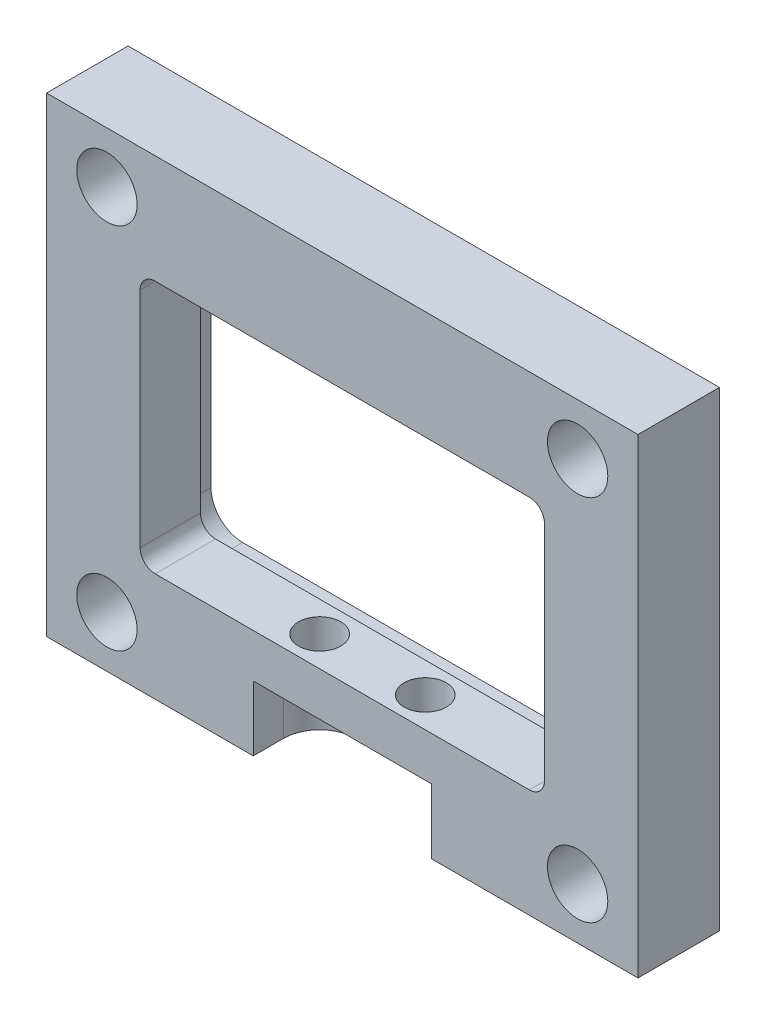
ISO-10303-21;
HEADER;
FILE_DESCRIPTION(('STEP AP214'),'2;1');
FILE_NAME('part.step','',(''),(''),'','','');
FILE_SCHEMA(('AUTOMOTIVE_DESIGN { 1 0 10303 214 1 1 1 1 }'));
ENDSEC;
DATA;
#1=APPLICATION_CONTEXT('core data for automotive mechanical design processes');
#2=APPLICATION_PROTOCOL_DEFINITION('international standard','automotive_design',2000,#1);
#3=PRODUCT_CONTEXT('',#1,'mechanical');
#4=PRODUCT('Part','Part','',(#3));
#5=PRODUCT_RELATED_PRODUCT_CATEGORY('part','',(#4));
#6=PRODUCT_DEFINITION_FORMATION('','',#4);
#7=PRODUCT_DEFINITION_CONTEXT('part definition',#1,'design');
#8=PRODUCT_DEFINITION('design','',#6,#7);
#9=PRODUCT_DEFINITION_SHAPE('','',#8);
#10=(LENGTH_UNIT() NAMED_UNIT(*) SI_UNIT(.MILLI.,.METRE.));
#11=(NAMED_UNIT(*) PLANE_ANGLE_UNIT() SI_UNIT($,.RADIAN.));
#12=(NAMED_UNIT(*) SI_UNIT($,.STERADIAN.) SOLID_ANGLE_UNIT());
#13=UNCERTAINTY_MEASURE_WITH_UNIT(LENGTH_MEASURE(1.E-05),#10,'distance_accuracy_value','');
#14=(GEOMETRIC_REPRESENTATION_CONTEXT(3) GLOBAL_UNCERTAINTY_ASSIGNED_CONTEXT((#13)) GLOBAL_UNIT_ASSIGNED_CONTEXT((#10,
#11,#12)) REPRESENTATION_CONTEXT('',''));
#15=CARTESIAN_POINT('',(0.,0.,0.));
#16=DIRECTION('',(0.,0.,1.));
#17=DIRECTION('',(1.,0.,0.));
#18=AXIS2_PLACEMENT_3D('',#15,#16,#17);
#19=CARTESIAN_POINT('',(57.,-42.0000000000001,27.));
#20=DIRECTION('',(0.,-1.,0.));
#21=DIRECTION('',(0.,0.,1.));
#22=AXIS2_PLACEMENT_3D('',#19,#20,#21);
#23=PLANE('',#22);
#24=CARTESIAN_POINT('',(-17.5,-42.,17.0000000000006));
#25=DIRECTION('',(0.,-1.,0.));
#26=DIRECTION('',(1.,0.,0.));
#27=AXIS2_PLACEMENT_3D('',#24,#25,#26);
#28=CIRCLE('',#27,6.99999999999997);
#29=CARTESIAN_POINT('',(-10.5,-42.,17.0000000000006));
#30=VERTEX_POINT('',#29);
#31=EDGE_CURVE('E1139',#30,#30,#28,.T.);
#32=ORIENTED_EDGE('',*,*,#31,.T.);
#33=EDGE_LOOP('',(#32));
#34=FACE_BOUND('',#33,.T.);
#35=CARTESIAN_POINT('',(17.5,-42.0000000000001,17.0000000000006));
#36=DIRECTION('',(0.,-1.,0.));
#37=DIRECTION('',(1.,0.,0.));
#38=AXIS2_PLACEMENT_3D('',#35,#36,#37);
#39=CIRCLE('',#38,6.99999999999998);
#40=CARTESIAN_POINT('',(24.5,-42.0000000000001,17.0000000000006));
#41=VERTEX_POINT('',#40);
#42=EDGE_CURVE('E251',#41,#41,#39,.T.);
#43=ORIENTED_EDGE('',*,*,#42,.T.);
#44=EDGE_LOOP('',(#43));
#45=FACE_BOUND('',#44,.T.);
#46=DIRECTION('',(-1.,0.,0.));
#47=VECTOR('',#46,1.);
#48=CARTESIAN_POINT('',(57.,-42.0000000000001,7.));
#49=LINE('',#48,#47);
#50=CARTESIAN_POINT('',(62.,-42.0000000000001,7.));
#51=VERTEX_POINT('',#50);
#52=CARTESIAN_POINT('',(-62.,-42.,7.));
#53=VERTEX_POINT('',#52);
#54=EDGE_CURVE('E492',#51,#53,#49,.T.);
#55=ORIENTED_EDGE('',*,*,#54,.T.);
#56=DIRECTION('',(0.,0.,1.));
#57=VECTOR('',#56,1.);
#58=CARTESIAN_POINT('',(-62.,-42.,0.));
#59=LINE('',#58,#57);
#60=CARTESIAN_POINT('',(-62.,-42.,27.));
#61=VERTEX_POINT('',#60);
#62=EDGE_CURVE('E376',#53,#61,#59,.T.);
#63=ORIENTED_EDGE('',*,*,#62,.T.);
#64=DIRECTION('',(-1.,0.,0.));
#65=VECTOR('',#64,1.);
#66=CARTESIAN_POINT('',(57.,-42.0000000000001,27.));
#67=LINE('',#66,#65);
#68=CARTESIAN_POINT('',(62.,-42.,27.));
#69=VERTEX_POINT('',#68);
#70=EDGE_CURVE('E500',#69,#61,#67,.T.);
#71=ORIENTED_EDGE('',*,*,#70,.F.);
#72=DIRECTION('',(0.,0.,1.));
#73=VECTOR('',#72,1.);
#74=CARTESIAN_POINT('',(62.,-42.,0.));
#75=LINE('',#74,#73);
#76=EDGE_CURVE('E373',#51,#69,#75,.T.);
#77=ORIENTED_EDGE('',*,*,#76,.F.);
#78=EDGE_LOOP('',(#55,#63,#71,#77));
#79=FACE_BOUND('',#78,.T.);
#80=ADVANCED_FACE('F45',(#34,#45,#79),#23,.F.);
#81=CARTESIAN_POINT('',(17.5,-56.5,17.0000000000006));
#82=DIRECTION('',(0.,1.,0.));
#83=DIRECTION('',(0.,0.,1.));
#84=AXIS2_PLACEMENT_3D('',#81,#82,#83);
#85=PLANE('',#84);
#86=CARTESIAN_POINT('',(-17.5,-56.5,17.0000000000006));
#87=DIRECTION('',(0.,-1.,0.));
#88=DIRECTION('',(0.,0.,-1.));
#89=AXIS2_PLACEMENT_3D('',#86,#87,#88);
#90=CIRCLE('',#89,6.99999999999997);
#91=CARTESIAN_POINT('',(-17.5,-56.5,10.0000000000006));
#92=VERTEX_POINT('',#91);
#93=EDGE_CURVE('E1137',#92,#92,#90,.T.);
#94=ORIENTED_EDGE('',*,*,#93,.F.);
#95=EDGE_LOOP('',(#94));
#96=FACE_BOUND('',#95,.T.);
#97=CARTESIAN_POINT('',(17.5,-56.5,17.0000000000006));
#98=DIRECTION('',(0.,-1.,0.));
#99=DIRECTION('',(0.,0.,-1.));
#100=AXIS2_PLACEMENT_3D('',#97,#98,#99);
#101=CIRCLE('',#100,6.99999999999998);
#102=CARTESIAN_POINT('',(17.5,-56.5,10.0000000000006));
#103=VERTEX_POINT('',#102);
#104=EDGE_CURVE('E254',#103,#103,#101,.T.);
#105=ORIENTED_EDGE('',*,*,#104,.F.);
#106=EDGE_LOOP('',(#105));
#107=FACE_BOUND('',#106,.T.);
#108=CARTESIAN_POINT('',(17.5,-56.5,17.0000000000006));
#109=DIRECTION('',(0.,1.,0.));
#110=DIRECTION('',(0.,0.,1.));
#111=AXIS2_PLACEMENT_3D('',#108,#109,#110);
#112=CIRCLE('',#111,12.);
#113=CARTESIAN_POINT('',(29.5,-56.5,17.0000000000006));
#114=VERTEX_POINT('',#113);
#115=CARTESIAN_POINT('',(17.5,-56.5,5.0000000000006));
#116=VERTEX_POINT('',#115);
#117=EDGE_CURVE('E245',#114,#116,#112,.T.);
#118=ORIENTED_EDGE('',*,*,#117,.F.);
#119=DIRECTION('',(0.,0.,-1.));
#120=VECTOR('',#119,1.);
#121=CARTESIAN_POINT('',(29.5,-56.5,17.0000000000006));
#122=LINE('',#121,#120);
#123=CARTESIAN_POINT('',(29.5,-56.5,27.));
#124=VERTEX_POINT('',#123);
#125=EDGE_CURVE('E273',#124,#114,#122,.T.);
#126=ORIENTED_EDGE('',*,*,#125,.F.);
#127=DIRECTION('',(1.,0.,0.));
#128=VECTOR('',#127,1.);
#129=CARTESIAN_POINT('',(-29.5,-56.5,27.));
#130=LINE('',#129,#128);
#131=CARTESIAN_POINT('',(-29.5,-56.5,27.));
#132=VERTEX_POINT('',#131);
#133=EDGE_CURVE('E270',#132,#124,#130,.T.);
#134=ORIENTED_EDGE('',*,*,#133,.F.);
#135=DIRECTION('',(0.,0.,1.));
#136=VECTOR('',#135,1.);
#137=CARTESIAN_POINT('',(-29.5,-56.5,17.0000000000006));
#138=LINE('',#137,#136);
#139=CARTESIAN_POINT('',(-29.5,-56.5,17.0000000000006));
#140=VERTEX_POINT('',#139);
#141=EDGE_CURVE('E268',#140,#132,#138,.T.);
#142=ORIENTED_EDGE('',*,*,#141,.F.);
#143=CARTESIAN_POINT('',(-17.5,-56.5,17.0000000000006));
#144=DIRECTION('',(0.,1.,0.));
#145=DIRECTION('',(0.,0.,1.));
#146=AXIS2_PLACEMENT_3D('',#143,#144,#145);
#147=CIRCLE('',#146,12.);
#148=CARTESIAN_POINT('',(-17.5,-56.5,5.00000000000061));
#149=VERTEX_POINT('',#148);
#150=EDGE_CURVE('E266',#149,#140,#147,.T.);
#151=ORIENTED_EDGE('',*,*,#150,.F.);
#152=DIRECTION('',(-1.,0.,0.));
#153=VECTOR('',#152,1.);
#154=CARTESIAN_POINT('',(17.5,-56.5,5.0000000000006));
#155=LINE('',#154,#153);
#156=EDGE_CURVE('E264',#116,#149,#155,.T.);
#157=ORIENTED_EDGE('',*,*,#156,.F.);
#158=EDGE_LOOP('',(#118,#126,#134,#142,#151,#157));
#159=FACE_BOUND('',#158,.T.);
#160=ADVANCED_FACE('F549',(#96,#107,#159),#85,.F.);
#161=CARTESIAN_POINT('',(0.,0.,27.));
#162=DIRECTION('',(0.,0.,1.));
#163=DIRECTION('',(1.,0.,0.));
#164=AXIS2_PLACEMENT_3D('',#161,#162,#163);
#165=PLANE('',#164);
#166=CARTESIAN_POINT('',(-78.,-61.,27.));
#167=DIRECTION('',(0.,0.,1.));
#168=DIRECTION('',(1.,0.,0.));
#169=AXIS2_PLACEMENT_3D('',#166,#167,#168);
#170=CIRCLE('',#169,10.);
#171=CARTESIAN_POINT('',(-68.,-61.,27.));
#172=VERTEX_POINT('',#171);
#173=EDGE_CURVE('E421',#172,#172,#170,.T.);
#174=ORIENTED_EDGE('',*,*,#173,.F.);
#175=EDGE_LOOP('',(#174));
#176=FACE_BOUND('',#175,.T.);
#177=CARTESIAN_POINT('',(78.,-61.,27.));
#178=DIRECTION('',(0.,0.,1.));
#179=DIRECTION('',(1.,0.,0.));
#180=AXIS2_PLACEMENT_3D('',#177,#178,#179);
#181=CIRCLE('',#180,10.);
#182=CARTESIAN_POINT('',(88.,-61.,27.));
#183=VERTEX_POINT('',#182);
#184=EDGE_CURVE('E413',#183,#183,#181,.T.);
#185=ORIENTED_EDGE('',*,*,#184,.F.);
#186=EDGE_LOOP('',(#185));
#187=FACE_BOUND('',#186,.T.);
#188=CARTESIAN_POINT('',(-78.,61.,27.));
#189=DIRECTION('',(0.,0.,1.));
#190=DIRECTION('',(1.,0.,0.));
#191=AXIS2_PLACEMENT_3D('',#188,#189,#190);
#192=CIRCLE('',#191,10.);
#193=CARTESIAN_POINT('',(-68.,61.,27.));
#194=VERTEX_POINT('',#193);
#195=EDGE_CURVE('E405',#194,#194,#192,.T.);
#196=ORIENTED_EDGE('',*,*,#195,.F.);
#197=EDGE_LOOP('',(#196));
#198=FACE_BOUND('',#197,.T.);
#199=CARTESIAN_POINT('',(78.,61.,27.));
#200=DIRECTION('',(0.,0.,1.));
#201=DIRECTION('',(1.,0.,0.));
#202=AXIS2_PLACEMENT_3D('',#199,#200,#201);
#203=CIRCLE('',#202,10.);
#204=CARTESIAN_POINT('',(88.,61.,27.));
#205=VERTEX_POINT('',#204);
#206=EDGE_CURVE('E404',#205,#205,#203,.T.);
#207=ORIENTED_EDGE('',*,*,#206,.F.);
#208=EDGE_LOOP('',(#207));
#209=FACE_BOUND('',#208,.T.);
#210=DIRECTION('',(1.,0.,0.));
#211=VECTOR('',#210,1.);
#212=CARTESIAN_POINT('',(57.,42.,27.));
#213=LINE('',#212,#211);
#214=CARTESIAN_POINT('',(-62.,42.,27.));
#215=VERTEX_POINT('',#214);
#216=CARTESIAN_POINT('',(62.,42.,27.));
#217=VERTEX_POINT('',#216);
#218=EDGE_CURVE('E387',#215,#217,#213,.T.);
#219=ORIENTED_EDGE('',*,*,#218,.T.);
#220=CARTESIAN_POINT('',(62.,37.,27.));
#221=DIRECTION('',(0.,0.,1.));
#222=DIRECTION('',(-1.,0.,0.));
#223=AXIS2_PLACEMENT_3D('',#220,#221,#222);
#224=CIRCLE('',#223,5.);
#225=CARTESIAN_POINT('',(67.,37.,27.));
#226=VERTEX_POINT('',#225);
#227=EDGE_CURVE('E356',#226,#217,#224,.T.);
#228=ORIENTED_EDGE('',*,*,#227,.F.);
#229=DIRECTION('',(0.,-1.,0.));
#230=VECTOR('',#229,1.);
#231=CARTESIAN_POINT('',(67.,32.,27.));
#232=LINE('',#231,#230);
#233=CARTESIAN_POINT('',(67.,-37.0000000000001,27.));
#234=VERTEX_POINT('',#233);
#235=EDGE_CURVE('E498',#226,#234,#232,.T.);
#236=ORIENTED_EDGE('',*,*,#235,.T.);
#237=CARTESIAN_POINT('',(62.,-37.0000000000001,27.));
#238=DIRECTION('',(0.,0.,1.));
#239=DIRECTION('',(-1.,0.,0.));
#240=AXIS2_PLACEMENT_3D('',#237,#238,#239);
#241=CIRCLE('',#240,5.);
#242=EDGE_CURVE('E353',#69,#234,#241,.T.);
#243=ORIENTED_EDGE('',*,*,#242,.F.);
#244=ORIENTED_EDGE('',*,*,#70,.T.);
#245=CARTESIAN_POINT('',(-62.,-37.,27.));
#246=DIRECTION('',(0.,0.,1.));
#247=DIRECTION('',(-1.,0.,0.));
#248=AXIS2_PLACEMENT_3D('',#245,#246,#247);
#249=CIRCLE('',#248,5.);
#250=CARTESIAN_POINT('',(-67.,-37.,27.));
#251=VERTEX_POINT('',#250);
#252=EDGE_CURVE('E350',#251,#61,#249,.T.);
#253=ORIENTED_EDGE('',*,*,#252,.F.);
#254=DIRECTION('',(0.,1.,0.));
#255=VECTOR('',#254,1.);
#256=CARTESIAN_POINT('',(-67.,32.,27.));
#257=LINE('',#256,#255);
#258=CARTESIAN_POINT('',(-67.,37.,27.));
#259=VERTEX_POINT('',#258);
#260=EDGE_CURVE('E455',#251,#259,#257,.T.);
#261=ORIENTED_EDGE('',*,*,#260,.T.);
#262=CARTESIAN_POINT('',(-62.,37.,27.));
#263=DIRECTION('',(0.,0.,1.));
#264=DIRECTION('',(-1.,0.,0.));
#265=AXIS2_PLACEMENT_3D('',#262,#263,#264);
#266=CIRCLE('',#265,5.);
#267=EDGE_CURVE('E334',#215,#259,#266,.T.);
#268=ORIENTED_EDGE('',*,*,#267,.F.);
#269=EDGE_LOOP('',(#219,#228,#236,#243,#244,#253,#261,#268));
#270=FACE_BOUND('',#269,.T.);
#271=DIRECTION('',(-1.,0.,0.));
#272=VECTOR('',#271,1.);
#273=CARTESIAN_POINT('',(0.,-78.,27.));
#274=LINE('',#273,#272);
#275=CARTESIAN_POINT('',(-29.5,-78.,27.));
#276=VERTEX_POINT('',#275);
#277=CARTESIAN_POINT('',(-98.,-78.,27.));
#278=VERTEX_POINT('',#277);
#279=EDGE_CURVE('E433',#276,#278,#274,.T.);
#280=ORIENTED_EDGE('',*,*,#279,.F.);
#281=DIRECTION('',(0.,-1.,0.));
#282=VECTOR('',#281,1.);
#283=CARTESIAN_POINT('',(-29.5,-56.5,27.));
#284=LINE('',#283,#282);
#285=EDGE_CURVE('E280',#132,#276,#284,.T.);
#286=ORIENTED_EDGE('',*,*,#285,.F.);
#287=ORIENTED_EDGE('',*,*,#133,.T.);
#288=DIRECTION('',(0.,-1.,0.));
#289=VECTOR('',#288,1.);
#290=CARTESIAN_POINT('',(29.5,-56.5,27.));
#291=LINE('',#290,#289);
#292=CARTESIAN_POINT('',(29.5,-78.,27.));
#293=VERTEX_POINT('',#292);
#294=EDGE_CURVE('E277',#124,#293,#291,.T.);
#295=ORIENTED_EDGE('',*,*,#294,.T.);
#296=CARTESIAN_POINT('',(98.,-78.,27.));
#297=VERTEX_POINT('',#296);
#298=EDGE_CURVE('E430',#297,#293,#274,.T.);
#299=ORIENTED_EDGE('',*,*,#298,.F.);
#300=DIRECTION('',(0.,-1.,0.));
#301=VECTOR('',#300,1.);
#302=CARTESIAN_POINT('',(98.,0.,27.));
#303=LINE('',#302,#301);
#304=CARTESIAN_POINT('',(98.,78.,27.));
#305=VERTEX_POINT('',#304);
#306=EDGE_CURVE('E429',#305,#297,#303,.T.);
#307=ORIENTED_EDGE('',*,*,#306,.F.);
#308=DIRECTION('',(1.,0.,0.));
#309=VECTOR('',#308,1.);
#310=CARTESIAN_POINT('',(0.,78.,27.));
#311=LINE('',#310,#309);
#312=CARTESIAN_POINT('',(-98.,78.,27.));
#313=VERTEX_POINT('',#312);
#314=EDGE_CURVE('E438',#313,#305,#311,.T.);
#315=ORIENTED_EDGE('',*,*,#314,.F.);
#316=DIRECTION('',(0.,1.,0.));
#317=VECTOR('',#316,1.);
#318=CARTESIAN_POINT('',(-98.,0.,27.));
#319=LINE('',#318,#317);
#320=EDGE_CURVE('E434',#278,#313,#319,.T.);
#321=ORIENTED_EDGE('',*,*,#320,.F.);
#322=EDGE_LOOP('',(#280,#286,#287,#295,#299,#307,#315,#321));
#323=FACE_BOUND('',#322,.T.);
#324=ADVANCED_FACE('F529',(#176,#187,#198,#209,#270,#323),#165,.T.);
#325=CARTESIAN_POINT('',(0.,-78.,0.));
#326=DIRECTION('',(0.,-1.,0.));
#327=DIRECTION('',(0.,0.,-1.));
#328=AXIS2_PLACEMENT_3D('',#325,#326,#327);
#329=PLANE('',#328);
#330=CARTESIAN_POINT('',(-17.5,-78.,17.0000000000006));
#331=DIRECTION('',(0.,1.,0.));
#332=DIRECTION('',(0.,0.,1.));
#333=AXIS2_PLACEMENT_3D('',#330,#331,#332);
#334=CIRCLE('',#333,12.);
#335=CARTESIAN_POINT('',(-17.5,-78.,5.00000000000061));
#336=VERTEX_POINT('',#335);
#337=CARTESIAN_POINT('',(-29.5,-78.,17.0000000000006));
#338=VERTEX_POINT('',#337);
#339=EDGE_CURVE('E240',#336,#338,#334,.T.);
#340=ORIENTED_EDGE('',*,*,#339,.T.);
#341=DIRECTION('',(0.,0.,1.));
#342=VECTOR('',#341,1.);
#343=CARTESIAN_POINT('',(-29.5,-78.,17.0000000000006));
#344=LINE('',#343,#342);
#345=EDGE_CURVE('E259',#338,#276,#344,.T.);
#346=ORIENTED_EDGE('',*,*,#345,.T.);
#347=ORIENTED_EDGE('',*,*,#279,.T.);
#348=DIRECTION('',(0.,0.,1.));
#349=VECTOR('',#348,1.);
#350=CARTESIAN_POINT('',(-98.,-78.,0.));
#351=LINE('',#350,#349);
#352=CARTESIAN_POINT('',(-98.,-78.,0.));
#353=VERTEX_POINT('',#352);
#354=EDGE_CURVE('E437',#353,#278,#351,.T.);
#355=ORIENTED_EDGE('',*,*,#354,.F.);
#356=DIRECTION('',(1.,0.,0.));
#357=VECTOR('',#356,1.);
#358=CARTESIAN_POINT('',(0.,-78.,0.));
#359=LINE('',#358,#357);
#360=CARTESIAN_POINT('',(98.,-78.,0.));
#361=VERTEX_POINT('',#360);
#362=EDGE_CURVE('E432',#353,#361,#359,.T.);
#363=ORIENTED_EDGE('',*,*,#362,.T.);
#364=DIRECTION('',(0.,0.,1.));
#365=VECTOR('',#364,1.);
#366=CARTESIAN_POINT('',(98.,-78.,0.));
#367=LINE('',#366,#365);
#368=EDGE_CURVE('E452',#361,#297,#367,.T.);
#369=ORIENTED_EDGE('',*,*,#368,.T.);
#370=ORIENTED_EDGE('',*,*,#298,.T.);
#371=DIRECTION('',(0.,0.,-1.));
#372=VECTOR('',#371,1.);
#373=CARTESIAN_POINT('',(29.5,-78.,17.0000000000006));
#374=LINE('',#373,#372);
#375=CARTESIAN_POINT('',(29.5,-78.,17.0000000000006));
#376=VERTEX_POINT('',#375);
#377=EDGE_CURVE('E250',#293,#376,#374,.T.);
#378=ORIENTED_EDGE('',*,*,#377,.T.);
#379=CARTESIAN_POINT('',(17.5,-78.,17.0000000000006));
#380=DIRECTION('',(0.,1.,0.));
#381=DIRECTION('',(0.,0.,1.));
#382=AXIS2_PLACEMENT_3D('',#379,#380,#381);
#383=CIRCLE('',#382,12.);
#384=CARTESIAN_POINT('',(17.5,-78.,5.0000000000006));
#385=VERTEX_POINT('',#384);
#386=EDGE_CURVE('E60',#376,#385,#383,.T.);
#387=ORIENTED_EDGE('',*,*,#386,.T.);
#388=DIRECTION('',(-1.,0.,0.));
#389=VECTOR('',#388,1.);
#390=CARTESIAN_POINT('',(17.5,-78.,5.0000000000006));
#391=LINE('',#390,#389);
#392=EDGE_CURVE('E232',#385,#336,#391,.T.);
#393=ORIENTED_EDGE('',*,*,#392,.T.);
#394=EDGE_LOOP('',(#340,#346,#347,#355,#363,#369,#370,#378,#387,#393));
#395=FACE_BOUND('',#394,.T.);
#396=ADVANCED_FACE('F248',(#395),#329,.T.);
#397=CARTESIAN_POINT('',(0.,0.,0.));
#398=DIRECTION('',(0.,0.,-1.));
#399=DIRECTION('',(-1.,0.,0.));
#400=AXIS2_PLACEMENT_3D('',#397,#398,#399);
#401=PLANE('',#400);
#402=CARTESIAN_POINT('',(60.,34.9999999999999,0.));
#403=DIRECTION('',(0.,0.,-1.));
#404=DIRECTION('',(1.,0.,0.));
#405=AXIS2_PLACEMENT_3D('',#402,#403,#404);
#406=CIRCLE('',#405,10.5);
#407=CARTESIAN_POINT('',(60.,45.4999999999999,0.));
#408=VERTEX_POINT('',#407);
#409=CARTESIAN_POINT('',(70.5,34.9999999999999,0.));
#410=VERTEX_POINT('',#409);
#411=EDGE_CURVE('E68',#408,#410,#406,.T.);
#412=ORIENTED_EDGE('',*,*,#411,.F.);
#413=DIRECTION('',(1.,0.,0.));
#414=VECTOR('',#413,1.);
#415=CARTESIAN_POINT('',(60.,45.4999999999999,0.));
#416=LINE('',#415,#414);
#417=CARTESIAN_POINT('',(-60.,45.5,0.));
#418=VERTEX_POINT('',#417);
#419=EDGE_CURVE('E304',#418,#408,#416,.T.);
#420=ORIENTED_EDGE('',*,*,#419,.F.);
#421=CARTESIAN_POINT('',(-60.,35.,0.));
#422=DIRECTION('',(0.,0.,-1.));
#423=DIRECTION('',(1.,0.,0.));
#424=AXIS2_PLACEMENT_3D('',#421,#422,#423);
#425=CIRCLE('',#424,10.5);
#426=CARTESIAN_POINT('',(-70.5,35.,0.));
#427=VERTEX_POINT('',#426);
#428=EDGE_CURVE('E301',#427,#418,#425,.T.);
#429=ORIENTED_EDGE('',*,*,#428,.F.);
#430=DIRECTION('',(0.,1.,0.));
#431=VECTOR('',#430,1.);
#432=CARTESIAN_POINT('',(-70.5,-35.,0.));
#433=LINE('',#432,#431);
#434=CARTESIAN_POINT('',(-70.5,-35.,0.));
#435=VERTEX_POINT('',#434);
#436=EDGE_CURVE('E298',#435,#427,#433,.T.);
#437=ORIENTED_EDGE('',*,*,#436,.F.);
#438=CARTESIAN_POINT('',(-60.,-35.,0.));
#439=DIRECTION('',(0.,0.,-1.));
#440=DIRECTION('',(1.,0.,0.));
#441=AXIS2_PLACEMENT_3D('',#438,#439,#440);
#442=CIRCLE('',#441,10.5);
#443=CARTESIAN_POINT('',(-60.,-45.5,0.));
#444=VERTEX_POINT('',#443);
#445=EDGE_CURVE('E295',#444,#435,#442,.T.);
#446=ORIENTED_EDGE('',*,*,#445,.F.);
#447=DIRECTION('',(-1.,0.,0.));
#448=VECTOR('',#447,1.);
#449=CARTESIAN_POINT('',(-60.,-45.5,0.));
#450=LINE('',#449,#448);
#451=CARTESIAN_POINT('',(60.,-45.5000000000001,0.));
#452=VERTEX_POINT('',#451);
#453=EDGE_CURVE('E292',#452,#444,#450,.T.);
#454=ORIENTED_EDGE('',*,*,#453,.F.);
#455=CARTESIAN_POINT('',(60.,-35.,0.));
#456=DIRECTION('',(0.,0.,-1.));
#457=DIRECTION('',(-1.,0.,0.));
#458=AXIS2_PLACEMENT_3D('',#455,#456,#457);
#459=CIRCLE('',#458,10.5);
#460=CARTESIAN_POINT('',(70.5,-35.0000000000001,0.));
#461=VERTEX_POINT('',#460);
#462=EDGE_CURVE('E289',#461,#452,#459,.T.);
#463=ORIENTED_EDGE('',*,*,#462,.F.);
#464=DIRECTION('',(0.,-1.,0.));
#465=VECTOR('',#464,1.);
#466=CARTESIAN_POINT('',(70.5,-35.0000000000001,0.));
#467=LINE('',#466,#465);
#468=EDGE_CURVE('E286',#410,#461,#467,.T.);
#469=ORIENTED_EDGE('',*,*,#468,.F.);
#470=EDGE_LOOP('',(#412,#420,#429,#437,#446,#454,#463,#469));
#471=FACE_BOUND('',#470,.T.);
#472=CARTESIAN_POINT('',(-57.,61.,0.));
#473=DIRECTION('',(0.,0.,-1.));
#474=DIRECTION('',(-1.,0.,0.));
#475=AXIS2_PLACEMENT_3D('',#472,#473,#474);
#476=CIRCLE('',#475,4.188125);
#477=CARTESIAN_POINT('',(-61.188125,61.,0.));
#478=VERTEX_POINT('',#477);
#479=EDGE_CURVE('E363',#478,#478,#476,.F.);
#480=ORIENTED_EDGE('',*,*,#479,.T.);
#481=EDGE_LOOP('',(#480));
#482=FACE_BOUND('',#481,.T.);
#483=CARTESIAN_POINT('',(-57.,-61.,0.));
#484=DIRECTION('',(0.,0.,-1.));
#485=DIRECTION('',(-1.,0.,0.));
#486=AXIS2_PLACEMENT_3D('',#483,#484,#485);
#487=CIRCLE('',#486,4.188125);
#488=CARTESIAN_POINT('',(-61.188125,-61.,0.));
#489=VERTEX_POINT('',#488);
#490=EDGE_CURVE('E391',#489,#489,#487,.F.);
#491=ORIENTED_EDGE('',*,*,#490,.T.);
#492=EDGE_LOOP('',(#491));
#493=FACE_BOUND('',#492,.T.);
#494=CARTESIAN_POINT('',(78.,61.,0.));
#495=DIRECTION('',(0.,0.,-1.));
#496=DIRECTION('',(-1.,0.,0.));
#497=AXIS2_PLACEMENT_3D('',#494,#495,#496);
#498=CIRCLE('',#497,13.);
#499=CARTESIAN_POINT('',(65.,61.,0.));
#500=VERTEX_POINT('',#499);
#501=EDGE_CURVE('E396',#500,#500,#498,.T.);
#502=ORIENTED_EDGE('',*,*,#501,.F.);
#503=EDGE_LOOP('',(#502));
#504=FACE_BOUND('',#503,.T.);
#505=CARTESIAN_POINT('',(-78.,61.,0.));
#506=DIRECTION('',(0.,0.,-1.));
#507=DIRECTION('',(-1.,0.,0.));
#508=AXIS2_PLACEMENT_3D('',#505,#506,#507);
#509=CIRCLE('',#508,13.);
#510=CARTESIAN_POINT('',(-91.,61.,0.));
#511=VERTEX_POINT('',#510);
#512=EDGE_CURVE('E406',#511,#511,#509,.T.);
#513=ORIENTED_EDGE('',*,*,#512,.F.);
#514=EDGE_LOOP('',(#513));
#515=FACE_BOUND('',#514,.T.);
#516=CARTESIAN_POINT('',(78.,-61.,0.));
#517=DIRECTION('',(0.,0.,-1.));
#518=DIRECTION('',(-1.,0.,0.));
#519=AXIS2_PLACEMENT_3D('',#516,#517,#518);
#520=CIRCLE('',#519,13.);
#521=CARTESIAN_POINT('',(65.,-61.,0.));
#522=VERTEX_POINT('',#521);
#523=EDGE_CURVE('E414',#522,#522,#520,.T.);
#524=ORIENTED_EDGE('',*,*,#523,.F.);
#525=EDGE_LOOP('',(#524));
#526=FACE_BOUND('',#525,.T.);
#527=CARTESIAN_POINT('',(-78.,-61.,0.));
#528=DIRECTION('',(0.,0.,-1.));
#529=DIRECTION('',(-1.,0.,0.));
#530=AXIS2_PLACEMENT_3D('',#527,#528,#529);
#531=CIRCLE('',#530,13.);
#532=CARTESIAN_POINT('',(-91.,-61.,0.));
#533=VERTEX_POINT('',#532);
#534=EDGE_CURVE('E422',#533,#533,#531,.T.);
#535=ORIENTED_EDGE('',*,*,#534,.F.);
#536=EDGE_LOOP('',(#535));
#537=FACE_BOUND('',#536,.T.);
#538=DIRECTION('',(0.,1.,0.));
#539=VECTOR('',#538,1.);
#540=CARTESIAN_POINT('',(98.,0.,0.));
#541=LINE('',#540,#539);
#542=CARTESIAN_POINT('',(98.,78.,0.));
#543=VERTEX_POINT('',#542);
#544=EDGE_CURVE('E451',#361,#543,#541,.T.);
#545=ORIENTED_EDGE('',*,*,#544,.F.);
#546=ORIENTED_EDGE('',*,*,#362,.F.);
#547=DIRECTION('',(0.,-1.,0.));
#548=VECTOR('',#547,1.);
#549=CARTESIAN_POINT('',(-98.,0.,0.));
#550=LINE('',#549,#548);
#551=CARTESIAN_POINT('',(-98.,78.,0.));
#552=VERTEX_POINT('',#551);
#553=EDGE_CURVE('E436',#552,#353,#550,.T.);
#554=ORIENTED_EDGE('',*,*,#553,.F.);
#555=DIRECTION('',(-1.,0.,0.));
#556=VECTOR('',#555,1.);
#557=CARTESIAN_POINT('',(0.,78.,0.));
#558=LINE('',#557,#556);
#559=EDGE_CURVE('E440',#543,#552,#558,.T.);
#560=ORIENTED_EDGE('',*,*,#559,.F.);
#561=EDGE_LOOP('',(#545,#546,#554,#560));
#562=FACE_BOUND('',#561,.T.);
#563=CARTESIAN_POINT('',(57.,-61.,0.));
#564=DIRECTION('',(0.,0.,-1.));
#565=DIRECTION('',(-1.,0.,0.));
#566=AXIS2_PLACEMENT_3D('',#563,#564,#565);
#567=CIRCLE('',#566,4.188125);
#568=CARTESIAN_POINT('',(52.811875,-61.,0.));
#569=VERTEX_POINT('',#568);
#570=EDGE_CURVE('E388',#569,#569,#567,.F.);
#571=ORIENTED_EDGE('',*,*,#570,.T.);
#572=EDGE_LOOP('',(#571));
#573=FACE_BOUND('',#572,.T.);
#574=CARTESIAN_POINT('',(57.,61.,0.));
#575=DIRECTION('',(0.,0.,-1.));
#576=DIRECTION('',(-1.,0.,0.));
#577=AXIS2_PLACEMENT_3D('',#574,#575,#576);
#578=CIRCLE('',#577,4.188125);
#579=CARTESIAN_POINT('',(52.811875,61.,0.));
#580=VERTEX_POINT('',#579);
#581=EDGE_CURVE('E384',#580,#580,#578,.F.);
#582=ORIENTED_EDGE('',*,*,#581,.T.);
#583=EDGE_LOOP('',(#582));
#584=FACE_BOUND('',#583,.T.);
#585=ADVANCED_FACE('F47',(#471,#482,#493,#504,#515,#526,#537,#562,#573,#584),#401,.T.);
#586=CARTESIAN_POINT('',(-98.,0.,0.));
#587=DIRECTION('',(-1.,0.,0.));
#588=DIRECTION('',(0.,0.,1.));
#589=AXIS2_PLACEMENT_3D('',#586,#587,#588);
#590=PLANE('',#589);
#591=ORIENTED_EDGE('',*,*,#354,.T.);
#592=ORIENTED_EDGE('',*,*,#320,.T.);
#593=DIRECTION('',(0.,0.,1.));
#594=VECTOR('',#593,1.);
#595=CARTESIAN_POINT('',(-98.,78.,0.));
#596=LINE('',#595,#594);
#597=EDGE_CURVE('E441',#552,#313,#596,.T.);
#598=ORIENTED_EDGE('',*,*,#597,.F.);
#599=ORIENTED_EDGE('',*,*,#553,.T.);
#600=EDGE_LOOP('',(#591,#592,#598,#599));
#601=FACE_BOUND('',#600,.T.);
#602=ADVANCED_FACE('F773',(#601),#590,.T.);
#603=CARTESIAN_POINT('',(0.,78.,0.));
#604=DIRECTION('',(0.,1.,0.));
#605=DIRECTION('',(0.,0.,1.));
#606=AXIS2_PLACEMENT_3D('',#603,#604,#605);
#607=PLANE('',#606);
#608=ORIENTED_EDGE('',*,*,#597,.T.);
#609=ORIENTED_EDGE('',*,*,#314,.T.);
#610=DIRECTION('',(0.,0.,1.));
#611=VECTOR('',#610,1.);
#612=CARTESIAN_POINT('',(98.,78.,0.));
#613=LINE('',#612,#611);
#614=EDGE_CURVE('E444',#543,#305,#613,.T.);
#615=ORIENTED_EDGE('',*,*,#614,.F.);
#616=ORIENTED_EDGE('',*,*,#559,.T.);
#617=EDGE_LOOP('',(#608,#609,#615,#616));
#618=FACE_BOUND('',#617,.T.);
#619=ADVANCED_FACE('F763',(#618),#607,.T.);
#620=CARTESIAN_POINT('',(98.,0.,0.));
#621=DIRECTION('',(1.,0.,0.));
#622=DIRECTION('',(0.,0.,-1.));
#623=AXIS2_PLACEMENT_3D('',#620,#621,#622);
#624=PLANE('',#623);
#625=ORIENTED_EDGE('',*,*,#544,.T.);
#626=ORIENTED_EDGE('',*,*,#614,.T.);
#627=ORIENTED_EDGE('',*,*,#306,.T.);
#628=ORIENTED_EDGE('',*,*,#368,.F.);
#629=EDGE_LOOP('',(#625,#626,#627,#628));
#630=FACE_BOUND('',#629,.T.);
#631=ADVANCED_FACE('F753',(#630),#624,.T.);
#632=CARTESIAN_POINT('',(-78.,-61.,-1.));
#633=DIRECTION('',(0.,0.,1.));
#634=DIRECTION('',(0.,1.,0.));
#635=AXIS2_PLACEMENT_3D('',#632,#633,#634);
#636=CYLINDRICAL_SURFACE('',#635,10.);
#637=CARTESIAN_POINT('',(-78.,-61.,6.3));
#638=DIRECTION('',(0.,0.,1.));
#639=DIRECTION('',(1.,0.,0.));
#640=AXIS2_PLACEMENT_3D('',#637,#638,#639);
#641=CIRCLE('',#640,10.);
#642=CARTESIAN_POINT('',(-68.,-61.,6.3));
#643=VERTEX_POINT('',#642);
#644=EDGE_CURVE('E426',#643,#643,#641,.F.);
#645=ORIENTED_EDGE('',*,*,#644,.T.);
#646=EDGE_LOOP('',(#645));
#647=FACE_BOUND('',#646,.T.);
#648=ORIENTED_EDGE('',*,*,#173,.T.);
#649=EDGE_LOOP('',(#648));
#650=FACE_BOUND('',#649,.T.);
#651=ADVANCED_FACE('F744',(#647,#650),#636,.F.);
#652=CARTESIAN_POINT('',(78.,-61.,-1.));
#653=DIRECTION('',(0.,0.,1.));
#654=DIRECTION('',(0.,1.,0.));
#655=AXIS2_PLACEMENT_3D('',#652,#653,#654);
#656=CYLINDRICAL_SURFACE('',#655,10.);
#657=CARTESIAN_POINT('',(78.,-61.,6.3));
#658=DIRECTION('',(0.,0.,1.));
#659=DIRECTION('',(1.,0.,0.));
#660=AXIS2_PLACEMENT_3D('',#657,#658,#659);
#661=CIRCLE('',#660,10.);
#662=CARTESIAN_POINT('',(88.,-61.,6.3));
#663=VERTEX_POINT('',#662);
#664=EDGE_CURVE('E418',#663,#663,#661,.F.);
#665=ORIENTED_EDGE('',*,*,#664,.T.);
#666=EDGE_LOOP('',(#665));
#667=FACE_BOUND('',#666,.T.);
#668=ORIENTED_EDGE('',*,*,#184,.T.);
#669=EDGE_LOOP('',(#668));
#670=FACE_BOUND('',#669,.T.);
#671=ADVANCED_FACE('F590',(#667,#670),#656,.F.);
#672=CARTESIAN_POINT('',(-78.,61.,-1.));
#673=DIRECTION('',(0.,0.,1.));
#674=DIRECTION('',(0.,1.,0.));
#675=AXIS2_PLACEMENT_3D('',#672,#673,#674);
#676=CYLINDRICAL_SURFACE('',#675,10.);
#677=CARTESIAN_POINT('',(-78.,61.,6.3));
#678=DIRECTION('',(0.,0.,1.));
#679=DIRECTION('',(1.,0.,0.));
#680=AXIS2_PLACEMENT_3D('',#677,#678,#679);
#681=CIRCLE('',#680,10.);
#682=CARTESIAN_POINT('',(-68.,61.,6.3));
#683=VERTEX_POINT('',#682);
#684=EDGE_CURVE('E410',#683,#683,#681,.F.);
#685=ORIENTED_EDGE('',*,*,#684,.T.);
#686=EDGE_LOOP('',(#685));
#687=FACE_BOUND('',#686,.T.);
#688=ORIENTED_EDGE('',*,*,#195,.T.);
#689=EDGE_LOOP('',(#688));
#690=FACE_BOUND('',#689,.T.);
#691=ADVANCED_FACE('F580',(#687,#690),#676,.F.);
#692=CARTESIAN_POINT('',(78.,61.,-1.));
#693=DIRECTION('',(0.,0.,1.));
#694=DIRECTION('',(0.,1.,0.));
#695=AXIS2_PLACEMENT_3D('',#692,#693,#694);
#696=CYLINDRICAL_SURFACE('',#695,10.);
#697=CARTESIAN_POINT('',(78.,61.,6.3));
#698=DIRECTION('',(0.,0.,1.));
#699=DIRECTION('',(1.,0.,0.));
#700=AXIS2_PLACEMENT_3D('',#697,#698,#699);
#701=CIRCLE('',#700,10.);
#702=CARTESIAN_POINT('',(88.,61.,6.3));
#703=VERTEX_POINT('',#702);
#704=EDGE_CURVE('E401',#703,#703,#701,.F.);
#705=ORIENTED_EDGE('',*,*,#704,.T.);
#706=EDGE_LOOP('',(#705));
#707=FACE_BOUND('',#706,.T.);
#708=ORIENTED_EDGE('',*,*,#206,.T.);
#709=EDGE_LOOP('',(#708));
#710=FACE_BOUND('',#709,.T.);
#711=ADVANCED_FACE('F577',(#707,#710),#696,.F.);
#712=CARTESIAN_POINT('',(-78.,-61.,6.3));
#713=DIRECTION('',(0.,0.,1.));
#714=DIRECTION('',(1.,0.,0.));
#715=AXIS2_PLACEMENT_3D('',#712,#713,#714);
#716=PLANE('',#715);
#717=CARTESIAN_POINT('',(-78.,-61.,6.3));
#718=DIRECTION('',(0.,0.,-1.));
#719=DIRECTION('',(0.,1.,0.));
#720=AXIS2_PLACEMENT_3D('',#717,#718,#719);
#721=CIRCLE('',#720,13.);
#722=CARTESIAN_POINT('',(-78.,-48.,6.3));
#723=VERTEX_POINT('',#722);
#724=EDGE_CURVE('E425',#723,#723,#721,.T.);
#725=ORIENTED_EDGE('',*,*,#724,.T.);
#726=EDGE_LOOP('',(#725));
#727=FACE_BOUND('',#726,.T.);
#728=ORIENTED_EDGE('',*,*,#644,.F.);
#729=EDGE_LOOP('',(#728));
#730=FACE_BOUND('',#729,.T.);
#731=ADVANCED_FACE('F579',(#727,#730),#716,.F.);
#732=CARTESIAN_POINT('',(-78.,-61.,-1.));
#733=DIRECTION('',(0.,0.,1.));
#734=DIRECTION('',(0.,1.,0.));
#735=AXIS2_PLACEMENT_3D('',#732,#733,#734);
#736=CYLINDRICAL_SURFACE('',#735,13.);
#737=ORIENTED_EDGE('',*,*,#534,.T.);
#738=EDGE_LOOP('',(#737));
#739=FACE_BOUND('',#738,.T.);
#740=ORIENTED_EDGE('',*,*,#724,.F.);
#741=EDGE_LOOP('',(#740));
#742=FACE_BOUND('',#741,.T.);
#743=ADVANCED_FACE('F587',(#739,#742),#736,.F.);
#744=CARTESIAN_POINT('',(78.,-61.,6.3));
#745=DIRECTION('',(0.,0.,1.));
#746=DIRECTION('',(1.,0.,0.));
#747=AXIS2_PLACEMENT_3D('',#744,#745,#746);
#748=PLANE('',#747);
#749=CARTESIAN_POINT('',(78.,-61.,6.3));
#750=DIRECTION('',(0.,0.,-1.));
#751=DIRECTION('',(0.,1.,0.));
#752=AXIS2_PLACEMENT_3D('',#749,#750,#751);
#753=CIRCLE('',#752,13.);
#754=CARTESIAN_POINT('',(78.,-48.,6.3));
#755=VERTEX_POINT('',#754);
#756=EDGE_CURVE('E417',#755,#755,#753,.T.);
#757=ORIENTED_EDGE('',*,*,#756,.T.);
#758=EDGE_LOOP('',(#757));
#759=FACE_BOUND('',#758,.T.);
#760=ORIENTED_EDGE('',*,*,#664,.F.);
#761=EDGE_LOOP('',(#760));
#762=FACE_BOUND('',#761,.T.);
#763=ADVANCED_FACE('F596',(#759,#762),#748,.F.);
#764=CARTESIAN_POINT('',(78.,-61.,-1.));
#765=DIRECTION('',(0.,0.,1.));
#766=DIRECTION('',(0.,1.,0.));
#767=AXIS2_PLACEMENT_3D('',#764,#765,#766);
#768=CYLINDRICAL_SURFACE('',#767,13.);
#769=ORIENTED_EDGE('',*,*,#523,.T.);
#770=EDGE_LOOP('',(#769));
#771=FACE_BOUND('',#770,.T.);
#772=ORIENTED_EDGE('',*,*,#756,.F.);
#773=EDGE_LOOP('',(#772));
#774=FACE_BOUND('',#773,.T.);
#775=ADVANCED_FACE('F599',(#771,#774),#768,.F.);
#776=CARTESIAN_POINT('',(-78.,61.,6.3));
#777=DIRECTION('',(0.,0.,1.));
#778=DIRECTION('',(1.,0.,0.));
#779=AXIS2_PLACEMENT_3D('',#776,#777,#778);
#780=PLANE('',#779);
#781=CARTESIAN_POINT('',(-78.,61.,6.3));
#782=DIRECTION('',(0.,0.,-1.));
#783=DIRECTION('',(0.,1.,0.));
#784=AXIS2_PLACEMENT_3D('',#781,#782,#783);
#785=CIRCLE('',#784,13.);
#786=CARTESIAN_POINT('',(-78.,74.,6.3));
#787=VERTEX_POINT('',#786);
#788=EDGE_CURVE('E409',#787,#787,#785,.T.);
#789=ORIENTED_EDGE('',*,*,#788,.T.);
#790=EDGE_LOOP('',(#789));
#791=FACE_BOUND('',#790,.T.);
#792=ORIENTED_EDGE('',*,*,#684,.F.);
#793=EDGE_LOOP('',(#792));
#794=FACE_BOUND('',#793,.T.);
#795=ADVANCED_FACE('F602',(#791,#794),#780,.F.);
#796=CARTESIAN_POINT('',(-78.,61.,-1.));
#797=DIRECTION('',(0.,0.,1.));
#798=DIRECTION('',(0.,1.,0.));
#799=AXIS2_PLACEMENT_3D('',#796,#797,#798);
#800=CYLINDRICAL_SURFACE('',#799,13.);
#801=ORIENTED_EDGE('',*,*,#512,.T.);
#802=EDGE_LOOP('',(#801));
#803=FACE_BOUND('',#802,.T.);
#804=ORIENTED_EDGE('',*,*,#788,.F.);
#805=EDGE_LOOP('',(#804));
#806=FACE_BOUND('',#805,.T.);
#807=ADVANCED_FACE('F607',(#803,#806),#800,.F.);
#808=CARTESIAN_POINT('',(78.,61.,6.3));
#809=DIRECTION('',(0.,0.,1.));
#810=DIRECTION('',(1.,0.,0.));
#811=AXIS2_PLACEMENT_3D('',#808,#809,#810);
#812=PLANE('',#811);
#813=CARTESIAN_POINT('',(78.,61.,6.3));
#814=DIRECTION('',(0.,0.,-1.));
#815=DIRECTION('',(0.,1.,0.));
#816=AXIS2_PLACEMENT_3D('',#813,#814,#815);
#817=CIRCLE('',#816,13.);
#818=CARTESIAN_POINT('',(78.,74.,6.3));
#819=VERTEX_POINT('',#818);
#820=EDGE_CURVE('E400',#819,#819,#817,.T.);
#821=ORIENTED_EDGE('',*,*,#820,.T.);
#822=EDGE_LOOP('',(#821));
#823=FACE_BOUND('',#822,.T.);
#824=ORIENTED_EDGE('',*,*,#704,.F.);
#825=EDGE_LOOP('',(#824));
#826=FACE_BOUND('',#825,.T.);
#827=ADVANCED_FACE('F610',(#823,#826),#812,.F.);
#828=CARTESIAN_POINT('',(78.,61.,-1.));
#829=DIRECTION('',(0.,0.,1.));
#830=DIRECTION('',(0.,1.,0.));
#831=AXIS2_PLACEMENT_3D('',#828,#829,#830);
#832=CYLINDRICAL_SURFACE('',#831,13.);
#833=ORIENTED_EDGE('',*,*,#501,.T.);
#834=EDGE_LOOP('',(#833));
#835=FACE_BOUND('',#834,.T.);
#836=ORIENTED_EDGE('',*,*,#820,.F.);
#837=EDGE_LOOP('',(#836));
#838=FACE_BOUND('',#837,.T.);
#839=ADVANCED_FACE('F615',(#835,#838),#832,.F.);
#840=CARTESIAN_POINT('',(-57.,-61.,15.));
#841=DIRECTION('',(0.,0.,-1.));
#842=DIRECTION('',(0.,1.,0.));
#843=AXIS2_PLACEMENT_3D('',#840,#841,#842);
#844=CONICAL_SURFACE('',#843,4.188125,1.0471975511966);
#845=CARTESIAN_POINT('',(-57.,-61.,17.4180150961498));
#846=VERTEX_POINT('',#845);
#847=VERTEX_LOOP('',#846);
#848=FACE_BOUND('',#847,.T.);
#849=CARTESIAN_POINT('',(-57.,-61.,15.));
#850=DIRECTION('',(0.,0.,1.));
#851=DIRECTION('',(0.,-1.,0.));
#852=AXIS2_PLACEMENT_3D('',#849,#850,#851);
#853=CIRCLE('',#852,4.188125);
#854=CARTESIAN_POINT('',(-57.,-65.188125,15.));
#855=VERTEX_POINT('',#854);
#856=EDGE_CURVE('E399',#855,#855,#853,.T.);
#857=ORIENTED_EDGE('',*,*,#856,.F.);
#858=EDGE_LOOP('',(#857));
#859=FACE_BOUND('',#858,.T.);
#860=ADVANCED_FACE('F618',(#848,#859),#844,.F.);
#861=CARTESIAN_POINT('',(-57.,-61.,0.));
#862=DIRECTION('',(0.,0.,1.));
#863=DIRECTION('',(0.,-1.,0.));
#864=AXIS2_PLACEMENT_3D('',#861,#862,#863);
#865=CYLINDRICAL_SURFACE('',#864,4.188125);
#866=ORIENTED_EDGE('',*,*,#490,.F.);
#867=EDGE_LOOP('',(#866));
#868=FACE_BOUND('',#867,.T.);
#869=ORIENTED_EDGE('',*,*,#856,.T.);
#870=EDGE_LOOP('',(#869));
#871=FACE_BOUND('',#870,.T.);
#872=ADVANCED_FACE('F625',(#868,#871),#865,.F.);
#873=CARTESIAN_POINT('',(57.,-61.,15.));
#874=DIRECTION('',(0.,0.,-1.));
#875=DIRECTION('',(0.,1.,0.));
#876=AXIS2_PLACEMENT_3D('',#873,#874,#875);
#877=CONICAL_SURFACE('',#876,4.188125,1.0471975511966);
#878=CARTESIAN_POINT('',(57.,-61.,17.4180150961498));
#879=VERTEX_POINT('',#878);
#880=VERTEX_LOOP('',#879);
#881=FACE_BOUND('',#880,.T.);
#882=CARTESIAN_POINT('',(57.,-61.,15.));
#883=DIRECTION('',(0.,0.,1.));
#884=DIRECTION('',(0.,-1.,0.));
#885=AXIS2_PLACEMENT_3D('',#882,#883,#884);
#886=CIRCLE('',#885,4.188125);
#887=CARTESIAN_POINT('',(57.,-65.188125,15.));
#888=VERTEX_POINT('',#887);
#889=EDGE_CURVE('E482',#888,#888,#886,.T.);
#890=ORIENTED_EDGE('',*,*,#889,.F.);
#891=EDGE_LOOP('',(#890));
#892=FACE_BOUND('',#891,.T.);
#893=ADVANCED_FACE('F629',(#881,#892),#877,.F.);
#894=CARTESIAN_POINT('',(57.,-61.,0.));
#895=DIRECTION('',(0.,0.,1.));
#896=DIRECTION('',(0.,-1.,0.));
#897=AXIS2_PLACEMENT_3D('',#894,#895,#896);
#898=CYLINDRICAL_SURFACE('',#897,4.188125);
#899=ORIENTED_EDGE('',*,*,#570,.F.);
#900=EDGE_LOOP('',(#899));
#901=FACE_BOUND('',#900,.T.);
#902=ORIENTED_EDGE('',*,*,#889,.T.);
#903=EDGE_LOOP('',(#902));
#904=FACE_BOUND('',#903,.T.);
#905=ADVANCED_FACE('F633',(#901,#904),#898,.F.);
#906=CARTESIAN_POINT('',(-57.,61.,15.));
#907=DIRECTION('',(0.,0.,-1.));
#908=DIRECTION('',(0.,1.,0.));
#909=AXIS2_PLACEMENT_3D('',#906,#907,#908);
#910=CONICAL_SURFACE('',#909,4.188125,1.0471975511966);
#911=CARTESIAN_POINT('',(-57.,61.,17.4180150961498));
#912=VERTEX_POINT('',#911);
#913=VERTEX_LOOP('',#912);
#914=FACE_BOUND('',#913,.T.);
#915=CARTESIAN_POINT('',(-57.,61.,15.));
#916=DIRECTION('',(0.,0.,1.));
#917=DIRECTION('',(0.,-1.,0.));
#918=AXIS2_PLACEMENT_3D('',#915,#916,#917);
#919=CIRCLE('',#918,4.188125);
#920=CARTESIAN_POINT('',(-57.,56.811875,15.));
#921=VERTEX_POINT('',#920);
#922=EDGE_CURVE('E485',#921,#921,#919,.T.);
#923=ORIENTED_EDGE('',*,*,#922,.F.);
#924=EDGE_LOOP('',(#923));
#925=FACE_BOUND('',#924,.T.);
#926=ADVANCED_FACE('F637',(#914,#925),#910,.F.);
#927=CARTESIAN_POINT('',(-57.,61.,0.));
#928=DIRECTION('',(0.,0.,1.));
#929=DIRECTION('',(0.,-1.,0.));
#930=AXIS2_PLACEMENT_3D('',#927,#928,#929);
#931=CYLINDRICAL_SURFACE('',#930,4.188125);
#932=ORIENTED_EDGE('',*,*,#479,.F.);
#933=EDGE_LOOP('',(#932));
#934=FACE_BOUND('',#933,.T.);
#935=ORIENTED_EDGE('',*,*,#922,.T.);
#936=EDGE_LOOP('',(#935));
#937=FACE_BOUND('',#936,.T.);
#938=ADVANCED_FACE('F641',(#934,#937),#931,.F.);
#939=CARTESIAN_POINT('',(57.,61.,15.));
#940=DIRECTION('',(0.,0.,-1.));
#941=DIRECTION('',(0.,1.,0.));
#942=AXIS2_PLACEMENT_3D('',#939,#940,#941);
#943=CONICAL_SURFACE('',#942,4.188125,1.0471975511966);
#944=CARTESIAN_POINT('',(57.,61.,17.4180150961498));
#945=VERTEX_POINT('',#944);
#946=VERTEX_LOOP('',#945);
#947=FACE_BOUND('',#946,.T.);
#948=CARTESIAN_POINT('',(57.,61.,15.));
#949=DIRECTION('',(0.,0.,1.));
#950=DIRECTION('',(0.,-1.,0.));
#951=AXIS2_PLACEMENT_3D('',#948,#949,#950);
#952=CIRCLE('',#951,4.188125);
#953=CARTESIAN_POINT('',(57.,56.811875,15.));
#954=VERTEX_POINT('',#953);
#955=EDGE_CURVE('E488',#954,#954,#952,.T.);
#956=ORIENTED_EDGE('',*,*,#955,.F.);
#957=EDGE_LOOP('',(#956));
#958=FACE_BOUND('',#957,.T.);
#959=ADVANCED_FACE('F645',(#947,#958),#943,.F.);
#960=CARTESIAN_POINT('',(57.,61.,0.));
#961=DIRECTION('',(0.,0.,1.));
#962=DIRECTION('',(0.,-1.,0.));
#963=AXIS2_PLACEMENT_3D('',#960,#961,#962);
#964=CYLINDRICAL_SURFACE('',#963,4.188125);
#965=ORIENTED_EDGE('',*,*,#581,.F.);
#966=EDGE_LOOP('',(#965));
#967=FACE_BOUND('',#966,.T.);
#968=ORIENTED_EDGE('',*,*,#955,.T.);
#969=EDGE_LOOP('',(#968));
#970=FACE_BOUND('',#969,.T.);
#971=ADVANCED_FACE('F649',(#967,#970),#964,.F.);
#972=CARTESIAN_POINT('',(-67.,32.,27.));
#973=DIRECTION('',(-1.,0.,0.));
#974=DIRECTION('',(0.,-1.,0.));
#975=AXIS2_PLACEMENT_3D('',#972,#973,#974);
#976=PLANE('',#975);
#977=DIRECTION('',(0.,1.,0.));
#978=VECTOR('',#977,1.);
#979=CARTESIAN_POINT('',(-67.,32.,7.));
#980=LINE('',#979,#978);
#981=CARTESIAN_POINT('',(-67.,-37.,7.));
#982=VERTEX_POINT('',#981);
#983=CARTESIAN_POINT('',(-67.,37.,7.));
#984=VERTEX_POINT('',#983);
#985=EDGE_CURVE('E491',#982,#984,#980,.T.);
#986=ORIENTED_EDGE('',*,*,#985,.T.);
#987=DIRECTION('',(0.,0.,1.));
#988=VECTOR('',#987,1.);
#989=CARTESIAN_POINT('',(-67.,37.,0.));
#990=LINE('',#989,#988);
#991=EDGE_CURVE('E359',#984,#259,#990,.T.);
#992=ORIENTED_EDGE('',*,*,#991,.T.);
#993=ORIENTED_EDGE('',*,*,#260,.F.);
#994=DIRECTION('',(0.,0.,1.));
#995=VECTOR('',#994,1.);
#996=CARTESIAN_POINT('',(-67.,-37.,0.));
#997=LINE('',#996,#995);
#998=EDGE_CURVE('E379',#982,#251,#997,.T.);
#999=ORIENTED_EDGE('',*,*,#998,.F.);
#1000=EDGE_LOOP('',(#986,#992,#993,#999));
#1001=FACE_BOUND('',#1000,.T.);
#1002=ADVANCED_FACE('F540',(#1001),#976,.F.);
#1003=CARTESIAN_POINT('',(57.,42.,27.));
#1004=DIRECTION('',(0.,1.,0.));
#1005=DIRECTION('',(0.,0.,-1.));
#1006=AXIS2_PLACEMENT_3D('',#1003,#1004,#1005);
#1007=PLANE('',#1006);
#1008=DIRECTION('',(1.,0.,0.));
#1009=VECTOR('',#1008,1.);
#1010=CARTESIAN_POINT('',(57.,42.,7.));
#1011=LINE('',#1010,#1009);
#1012=CARTESIAN_POINT('',(-62.,42.,7.));
#1013=VERTEX_POINT('',#1012);
#1014=CARTESIAN_POINT('',(62.,42.,7.));
#1015=VERTEX_POINT('',#1014);
#1016=EDGE_CURVE('E495',#1013,#1015,#1011,.T.);
#1017=ORIENTED_EDGE('',*,*,#1016,.T.);
#1018=DIRECTION('',(0.,0.,1.));
#1019=VECTOR('',#1018,1.);
#1020=CARTESIAN_POINT('',(62.,42.,0.));
#1021=LINE('',#1020,#1019);
#1022=EDGE_CURVE('E364',#1015,#217,#1021,.T.);
#1023=ORIENTED_EDGE('',*,*,#1022,.T.);
#1024=ORIENTED_EDGE('',*,*,#218,.F.);
#1025=DIRECTION('',(0.,0.,1.));
#1026=VECTOR('',#1025,1.);
#1027=CARTESIAN_POINT('',(-62.,42.,0.));
#1028=LINE('',#1027,#1026);
#1029=EDGE_CURVE('E360',#1013,#215,#1028,.T.);
#1030=ORIENTED_EDGE('',*,*,#1029,.F.);
#1031=EDGE_LOOP('',(#1017,#1023,#1024,#1030));
#1032=FACE_BOUND('',#1031,.T.);
#1033=ADVANCED_FACE('F534',(#1032),#1007,.F.);
#1034=CARTESIAN_POINT('',(67.,32.,27.));
#1035=DIRECTION('',(1.,0.,0.));
#1036=DIRECTION('',(0.,0.,-1.));
#1037=AXIS2_PLACEMENT_3D('',#1034,#1035,#1036);
#1038=PLANE('',#1037);
#1039=DIRECTION('',(0.,-1.,0.));
#1040=VECTOR('',#1039,1.);
#1041=CARTESIAN_POINT('',(67.,32.,7.));
#1042=LINE('',#1041,#1040);
#1043=CARTESIAN_POINT('',(67.,37.,7.));
#1044=VERTEX_POINT('',#1043);
#1045=CARTESIAN_POINT('',(67.,-37.0000000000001,7.));
#1046=VERTEX_POINT('',#1045);
#1047=EDGE_CURVE('E494',#1044,#1046,#1042,.T.);
#1048=ORIENTED_EDGE('',*,*,#1047,.T.);
#1049=DIRECTION('',(0.,0.,1.));
#1050=VECTOR('',#1049,1.);
#1051=CARTESIAN_POINT('',(67.,-37.0000000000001,0.));
#1052=LINE('',#1051,#1050);
#1053=EDGE_CURVE('E370',#1046,#234,#1052,.T.);
#1054=ORIENTED_EDGE('',*,*,#1053,.T.);
#1055=ORIENTED_EDGE('',*,*,#235,.F.);
#1056=DIRECTION('',(0.,0.,1.));
#1057=VECTOR('',#1056,1.);
#1058=CARTESIAN_POINT('',(67.,37.,0.));
#1059=LINE('',#1058,#1057);
#1060=EDGE_CURVE('E367',#1044,#226,#1059,.T.);
#1061=ORIENTED_EDGE('',*,*,#1060,.F.);
#1062=EDGE_LOOP('',(#1048,#1054,#1055,#1061));
#1063=FACE_BOUND('',#1062,.T.);
#1064=ADVANCED_FACE('F522',(#1063),#1038,.F.);
#1065=CARTESIAN_POINT('',(-59.5,34.5,7.));
#1066=DIRECTION('',(0.,0.,1.));
#1067=DIRECTION('',(1.,0.,0.));
#1068=AXIS2_PLACEMENT_3D('',#1065,#1066,#1067);
#1069=PLANE('',#1068);
#1070=CARTESIAN_POINT('',(62.,37.,7.));
#1071=DIRECTION('',(0.,0.,1.));
#1072=DIRECTION('',(1.,0.,0.));
#1073=AXIS2_PLACEMENT_3D('',#1070,#1071,#1072);
#1074=CIRCLE('',#1073,5.);
#1075=EDGE_CURVE('E13',#1044,#1015,#1074,.T.);
#1076=ORIENTED_EDGE('',*,*,#1075,.T.);
#1077=ORIENTED_EDGE('',*,*,#1016,.F.);
#1078=CARTESIAN_POINT('',(-62.,37.,7.));
#1079=DIRECTION('',(0.,0.,1.));
#1080=DIRECTION('',(1.,0.,0.));
#1081=AXIS2_PLACEMENT_3D('',#1078,#1079,#1080);
#1082=CIRCLE('',#1081,5.);
#1083=EDGE_CURVE('E508',#1013,#984,#1082,.T.);
#1084=ORIENTED_EDGE('',*,*,#1083,.T.);
#1085=ORIENTED_EDGE('',*,*,#985,.F.);
#1086=CARTESIAN_POINT('',(-62.,-37.,7.));
#1087=DIRECTION('',(0.,0.,1.));
#1088=DIRECTION('',(1.,0.,0.));
#1089=AXIS2_PLACEMENT_3D('',#1086,#1087,#1088);
#1090=CIRCLE('',#1089,5.);
#1091=EDGE_CURVE('E505',#982,#53,#1090,.T.);
#1092=ORIENTED_EDGE('',*,*,#1091,.T.);
#1093=ORIENTED_EDGE('',*,*,#54,.F.);
#1094=CARTESIAN_POINT('',(62.,-37.0000000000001,7.));
#1095=DIRECTION('',(0.,0.,1.));
#1096=DIRECTION('',(1.,0.,0.));
#1097=AXIS2_PLACEMENT_3D('',#1094,#1095,#1096);
#1098=CIRCLE('',#1097,5.);
#1099=EDGE_CURVE('E53',#51,#1046,#1098,.T.);
#1100=ORIENTED_EDGE('',*,*,#1099,.T.);
#1101=ORIENTED_EDGE('',*,*,#1047,.F.);
#1102=EDGE_LOOP('',(#1076,#1077,#1084,#1085,#1092,#1093,#1100,#1101));
#1103=FACE_BOUND('',#1102,.T.);
#1104=CARTESIAN_POINT('',(60.,34.9999999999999,7.));
#1105=DIRECTION('',(0.,0.,-1.));
#1106=DIRECTION('',(1.,0.,0.));
#1107=AXIS2_PLACEMENT_3D('',#1104,#1105,#1106);
#1108=CIRCLE('',#1107,10.5);
#1109=CARTESIAN_POINT('',(60.,45.4999999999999,7.));
#1110=VERTEX_POINT('',#1109);
#1111=CARTESIAN_POINT('',(70.5,34.9999999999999,7.));
#1112=VERTEX_POINT('',#1111);
#1113=EDGE_CURVE('E307',#1110,#1112,#1108,.T.);
#1114=ORIENTED_EDGE('',*,*,#1113,.T.);
#1115=DIRECTION('',(0.,-1.,0.));
#1116=VECTOR('',#1115,1.);
#1117=CARTESIAN_POINT('',(70.5,-35.0000000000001,7.));
#1118=LINE('',#1117,#1116);
#1119=CARTESIAN_POINT('',(70.5,-35.0000000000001,7.));
#1120=VERTEX_POINT('',#1119);
#1121=EDGE_CURVE('E310',#1112,#1120,#1118,.T.);
#1122=ORIENTED_EDGE('',*,*,#1121,.T.);
#1123=CARTESIAN_POINT('',(60.,-35.,7.));
#1124=DIRECTION('',(0.,0.,-1.));
#1125=DIRECTION('',(-1.,0.,0.));
#1126=AXIS2_PLACEMENT_3D('',#1123,#1124,#1125);
#1127=CIRCLE('',#1126,10.5);
#1128=CARTESIAN_POINT('',(60.,-45.5000000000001,7.));
#1129=VERTEX_POINT('',#1128);
#1130=EDGE_CURVE('E313',#1120,#1129,#1127,.T.);
#1131=ORIENTED_EDGE('',*,*,#1130,.T.);
#1132=DIRECTION('',(-1.,0.,0.));
#1133=VECTOR('',#1132,1.);
#1134=CARTESIAN_POINT('',(-60.,-45.5,7.));
#1135=LINE('',#1134,#1133);
#1136=CARTESIAN_POINT('',(-60.,-45.5,7.));
#1137=VERTEX_POINT('',#1136);
#1138=EDGE_CURVE('E316',#1129,#1137,#1135,.T.);
#1139=ORIENTED_EDGE('',*,*,#1138,.T.);
#1140=CARTESIAN_POINT('',(-60.,-35.,7.));
#1141=DIRECTION('',(0.,0.,-1.));
#1142=DIRECTION('',(1.,0.,0.));
#1143=AXIS2_PLACEMENT_3D('',#1140,#1141,#1142);
#1144=CIRCLE('',#1143,10.5);
#1145=CARTESIAN_POINT('',(-70.5,-35.,7.));
#1146=VERTEX_POINT('',#1145);
#1147=EDGE_CURVE('E319',#1137,#1146,#1144,.T.);
#1148=ORIENTED_EDGE('',*,*,#1147,.T.);
#1149=DIRECTION('',(0.,1.,0.));
#1150=VECTOR('',#1149,1.);
#1151=CARTESIAN_POINT('',(-70.5,-35.,7.));
#1152=LINE('',#1151,#1150);
#1153=CARTESIAN_POINT('',(-70.5,35.,7.));
#1154=VERTEX_POINT('',#1153);
#1155=EDGE_CURVE('E322',#1146,#1154,#1152,.T.);
#1156=ORIENTED_EDGE('',*,*,#1155,.T.);
#1157=CARTESIAN_POINT('',(-60.,35.,7.));
#1158=DIRECTION('',(0.,0.,-1.));
#1159=DIRECTION('',(1.,0.,0.));
#1160=AXIS2_PLACEMENT_3D('',#1157,#1158,#1159);
#1161=CIRCLE('',#1160,10.5);
#1162=CARTESIAN_POINT('',(-60.,45.5,7.));
#1163=VERTEX_POINT('',#1162);
#1164=EDGE_CURVE('E325',#1154,#1163,#1161,.T.);
#1165=ORIENTED_EDGE('',*,*,#1164,.T.);
#1166=DIRECTION('',(1.,0.,0.));
#1167=VECTOR('',#1166,1.);
#1168=CARTESIAN_POINT('',(60.,45.4999999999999,7.));
#1169=LINE('',#1168,#1167);
#1170=EDGE_CURVE('E328',#1163,#1110,#1169,.T.);
#1171=ORIENTED_EDGE('',*,*,#1170,.T.);
#1172=EDGE_LOOP('',(#1114,#1122,#1131,#1139,#1148,#1156,#1165,#1171));
#1173=FACE_BOUND('',#1172,.T.);
#1174=ADVANCED_FACE('F513',(#1103,#1173),#1069,.F.);
#1175=CARTESIAN_POINT('',(-62.,37.,0.));
#1176=DIRECTION('',(0.,0.,1.));
#1177=DIRECTION('',(1.,0.,0.));
#1178=AXIS2_PLACEMENT_3D('',#1175,#1176,#1177);
#1179=CYLINDRICAL_SURFACE('',#1178,5.);
#1180=ORIENTED_EDGE('',*,*,#1029,.T.);
#1181=ORIENTED_EDGE('',*,*,#267,.T.);
#1182=ORIENTED_EDGE('',*,*,#991,.F.);
#1183=ORIENTED_EDGE('',*,*,#1083,.F.);
#1184=EDGE_LOOP('',(#1180,#1181,#1182,#1183));
#1185=FACE_BOUND('',#1184,.T.);
#1186=ADVANCED_FACE('F538',(#1185),#1179,.F.);
#1187=CARTESIAN_POINT('',(62.,37.,0.));
#1188=DIRECTION('',(0.,0.,1.));
#1189=DIRECTION('',(1.,0.,0.));
#1190=AXIS2_PLACEMENT_3D('',#1187,#1188,#1189);
#1191=CYLINDRICAL_SURFACE('',#1190,5.);
#1192=ORIENTED_EDGE('',*,*,#1060,.T.);
#1193=ORIENTED_EDGE('',*,*,#227,.T.);
#1194=ORIENTED_EDGE('',*,*,#1022,.F.);
#1195=ORIENTED_EDGE('',*,*,#1075,.F.);
#1196=EDGE_LOOP('',(#1192,#1193,#1194,#1195));
#1197=FACE_BOUND('',#1196,.T.);
#1198=ADVANCED_FACE('F526',(#1197),#1191,.F.);
#1199=CARTESIAN_POINT('',(-62.,-37.,0.));
#1200=DIRECTION('',(0.,0.,1.));
#1201=DIRECTION('',(1.,0.,0.));
#1202=AXIS2_PLACEMENT_3D('',#1199,#1200,#1201);
#1203=CYLINDRICAL_SURFACE('',#1202,5.);
#1204=ORIENTED_EDGE('',*,*,#998,.T.);
#1205=ORIENTED_EDGE('',*,*,#252,.T.);
#1206=ORIENTED_EDGE('',*,*,#62,.F.);
#1207=ORIENTED_EDGE('',*,*,#1091,.F.);
#1208=EDGE_LOOP('',(#1204,#1205,#1206,#1207));
#1209=FACE_BOUND('',#1208,.T.);
#1210=ADVANCED_FACE('F545',(#1209),#1203,.F.);
#1211=CARTESIAN_POINT('',(62.,-37.0000000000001,0.));
#1212=DIRECTION('',(0.,0.,1.));
#1213=DIRECTION('',(1.,0.,0.));
#1214=AXIS2_PLACEMENT_3D('',#1211,#1212,#1213);
#1215=CYLINDRICAL_SURFACE('',#1214,5.);
#1216=ORIENTED_EDGE('',*,*,#76,.T.);
#1217=ORIENTED_EDGE('',*,*,#242,.T.);
#1218=ORIENTED_EDGE('',*,*,#1053,.F.);
#1219=ORIENTED_EDGE('',*,*,#1099,.F.);
#1220=EDGE_LOOP('',(#1216,#1217,#1218,#1219));
#1221=FACE_BOUND('',#1220,.T.);
#1222=ADVANCED_FACE('F519',(#1221),#1215,.F.);
#1223=CARTESIAN_POINT('',(60.,34.9999999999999,7.));
#1224=DIRECTION('',(0.,0.,-1.));
#1225=DIRECTION('',(-1.,0.,0.));
#1226=AXIS2_PLACEMENT_3D('',#1223,#1224,#1225);
#1227=CYLINDRICAL_SURFACE('',#1226,10.5);
#1228=ORIENTED_EDGE('',*,*,#411,.T.);
#1229=DIRECTION('',(0.,0.,-1.));
#1230=VECTOR('',#1229,1.);
#1231=CARTESIAN_POINT('',(70.5,34.9999999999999,7.));
#1232=LINE('',#1231,#1230);
#1233=EDGE_CURVE('E331',#1112,#410,#1232,.T.);
#1234=ORIENTED_EDGE('',*,*,#1233,.F.);
#1235=ORIENTED_EDGE('',*,*,#1113,.F.);
#1236=DIRECTION('',(0.,0.,-1.));
#1237=VECTOR('',#1236,1.);
#1238=CARTESIAN_POINT('',(60.,45.4999999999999,7.));
#1239=LINE('',#1238,#1237);
#1240=EDGE_CURVE('E332',#1110,#408,#1239,.T.);
#1241=ORIENTED_EDGE('',*,*,#1240,.T.);
#1242=EDGE_LOOP('',(#1228,#1234,#1235,#1241));
#1243=FACE_BOUND('',#1242,.T.);
#1244=ADVANCED_FACE('F927',(#1243),#1227,.F.);
#1245=CARTESIAN_POINT('',(60.,45.4999999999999,7.));
#1246=DIRECTION('',(0.,1.,0.));
#1247=DIRECTION('',(-1.,0.,0.));
#1248=AXIS2_PLACEMENT_3D('',#1245,#1246,#1247);
#1249=PLANE('',#1248);
#1250=ORIENTED_EDGE('',*,*,#419,.T.);
#1251=ORIENTED_EDGE('',*,*,#1240,.F.);
#1252=ORIENTED_EDGE('',*,*,#1170,.F.);
#1253=DIRECTION('',(0.,0.,-1.));
#1254=VECTOR('',#1253,1.);
#1255=CARTESIAN_POINT('',(-60.,45.5,7.));
#1256=LINE('',#1255,#1254);
#1257=EDGE_CURVE('E335',#1163,#418,#1256,.T.);
#1258=ORIENTED_EDGE('',*,*,#1257,.T.);
#1259=EDGE_LOOP('',(#1250,#1251,#1252,#1258));
#1260=FACE_BOUND('',#1259,.T.);
#1261=ADVANCED_FACE('F919',(#1260),#1249,.F.);
#1262=CARTESIAN_POINT('',(-60.,35.,7.));
#1263=DIRECTION('',(0.,0.,-1.));
#1264=DIRECTION('',(-1.,0.,0.));
#1265=AXIS2_PLACEMENT_3D('',#1262,#1263,#1264);
#1266=CYLINDRICAL_SURFACE('',#1265,10.5);
#1267=ORIENTED_EDGE('',*,*,#428,.T.);
#1268=ORIENTED_EDGE('',*,*,#1257,.F.);
#1269=ORIENTED_EDGE('',*,*,#1164,.F.);
#1270=DIRECTION('',(0.,0.,-1.));
#1271=VECTOR('',#1270,1.);
#1272=CARTESIAN_POINT('',(-70.5,35.,7.));
#1273=LINE('',#1272,#1271);
#1274=EDGE_CURVE('E337',#1154,#427,#1273,.T.);
#1275=ORIENTED_EDGE('',*,*,#1274,.T.);
#1276=EDGE_LOOP('',(#1267,#1268,#1269,#1275));
#1277=FACE_BOUND('',#1276,.T.);
#1278=ADVANCED_FACE('F911',(#1277),#1266,.F.);
#1279=CARTESIAN_POINT('',(-70.5,-35.,7.));
#1280=DIRECTION('',(-1.,0.,0.));
#1281=DIRECTION('',(0.,-1.,0.));
#1282=AXIS2_PLACEMENT_3D('',#1279,#1280,#1281);
#1283=PLANE('',#1282);
#1284=ORIENTED_EDGE('',*,*,#436,.T.);
#1285=ORIENTED_EDGE('',*,*,#1274,.F.);
#1286=ORIENTED_EDGE('',*,*,#1155,.F.);
#1287=DIRECTION('',(0.,0.,-1.));
#1288=VECTOR('',#1287,1.);
#1289=CARTESIAN_POINT('',(-70.5,-35.,7.));
#1290=LINE('',#1289,#1288);
#1291=EDGE_CURVE('E339',#1146,#435,#1290,.T.);
#1292=ORIENTED_EDGE('',*,*,#1291,.T.);
#1293=EDGE_LOOP('',(#1284,#1285,#1286,#1292));
#1294=FACE_BOUND('',#1293,.T.);
#1295=ADVANCED_FACE('F903',(#1294),#1283,.F.);
#1296=CARTESIAN_POINT('',(-60.,-35.,7.));
#1297=DIRECTION('',(0.,0.,-1.));
#1298=DIRECTION('',(-1.,0.,0.));
#1299=AXIS2_PLACEMENT_3D('',#1296,#1297,#1298);
#1300=CYLINDRICAL_SURFACE('',#1299,10.5);
#1301=ORIENTED_EDGE('',*,*,#445,.T.);
#1302=ORIENTED_EDGE('',*,*,#1291,.F.);
#1303=ORIENTED_EDGE('',*,*,#1147,.F.);
#1304=DIRECTION('',(0.,0.,-1.));
#1305=VECTOR('',#1304,1.);
#1306=CARTESIAN_POINT('',(-60.,-45.5,7.));
#1307=LINE('',#1306,#1305);
#1308=EDGE_CURVE('E341',#1137,#444,#1307,.T.);
#1309=ORIENTED_EDGE('',*,*,#1308,.T.);
#1310=EDGE_LOOP('',(#1301,#1302,#1303,#1309));
#1311=FACE_BOUND('',#1310,.T.);
#1312=ADVANCED_FACE('F895',(#1311),#1300,.F.);
#1313=CARTESIAN_POINT('',(-60.,-45.5,7.));
#1314=DIRECTION('',(0.,-1.,0.));
#1315=DIRECTION('',(1.,0.,0.));
#1316=AXIS2_PLACEMENT_3D('',#1313,#1314,#1315);
#1317=PLANE('',#1316);
#1318=ORIENTED_EDGE('',*,*,#453,.T.);
#1319=ORIENTED_EDGE('',*,*,#1308,.F.);
#1320=ORIENTED_EDGE('',*,*,#1138,.F.);
#1321=DIRECTION('',(0.,0.,-1.));
#1322=VECTOR('',#1321,1.);
#1323=CARTESIAN_POINT('',(60.,-45.5000000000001,7.));
#1324=LINE('',#1323,#1322);
#1325=EDGE_CURVE('E343',#1129,#452,#1324,.T.);
#1326=ORIENTED_EDGE('',*,*,#1325,.T.);
#1327=EDGE_LOOP('',(#1318,#1319,#1320,#1326));
#1328=FACE_BOUND('',#1327,.T.);
#1329=ADVANCED_FACE('F887',(#1328),#1317,.F.);
#1330=CARTESIAN_POINT('',(60.,-35.,7.));
#1331=DIRECTION('',(0.,0.,-1.));
#1332=DIRECTION('',(-1.,0.,0.));
#1333=AXIS2_PLACEMENT_3D('',#1330,#1331,#1332);
#1334=CYLINDRICAL_SURFACE('',#1333,10.5);
#1335=ORIENTED_EDGE('',*,*,#462,.T.);
#1336=ORIENTED_EDGE('',*,*,#1325,.F.);
#1337=ORIENTED_EDGE('',*,*,#1130,.F.);
#1338=DIRECTION('',(0.,0.,-1.));
#1339=VECTOR('',#1338,1.);
#1340=CARTESIAN_POINT('',(70.5,-35.0000000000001,7.));
#1341=LINE('',#1340,#1339);
#1342=EDGE_CURVE('E345',#1120,#461,#1341,.T.);
#1343=ORIENTED_EDGE('',*,*,#1342,.T.);
#1344=EDGE_LOOP('',(#1335,#1336,#1337,#1343));
#1345=FACE_BOUND('',#1344,.T.);
#1346=ADVANCED_FACE('F880',(#1345),#1334,.F.);
#1347=CARTESIAN_POINT('',(70.5,-35.0000000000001,7.));
#1348=DIRECTION('',(1.,0.,0.));
#1349=DIRECTION('',(0.,1.,0.));
#1350=AXIS2_PLACEMENT_3D('',#1347,#1348,#1349);
#1351=PLANE('',#1350);
#1352=ORIENTED_EDGE('',*,*,#468,.T.);
#1353=ORIENTED_EDGE('',*,*,#1342,.F.);
#1354=ORIENTED_EDGE('',*,*,#1121,.F.);
#1355=ORIENTED_EDGE('',*,*,#1233,.T.);
#1356=EDGE_LOOP('',(#1352,#1353,#1354,#1355));
#1357=FACE_BOUND('',#1356,.T.);
#1358=ADVANCED_FACE('F874',(#1357),#1351,.F.);
#1359=CARTESIAN_POINT('',(17.5,-56.5,17.0000000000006));
#1360=DIRECTION('',(0.,-1.,0.));
#1361=DIRECTION('',(0.,0.,-1.));
#1362=AXIS2_PLACEMENT_3D('',#1359,#1360,#1361);
#1363=CYLINDRICAL_SURFACE('',#1362,12.);
#1364=ORIENTED_EDGE('',*,*,#386,.F.);
#1365=DIRECTION('',(0.,-1.,0.));
#1366=VECTOR('',#1365,1.);
#1367=CARTESIAN_POINT('',(29.5,-56.5,17.0000000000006));
#1368=LINE('',#1367,#1366);
#1369=EDGE_CURVE('E275',#114,#376,#1368,.T.);
#1370=ORIENTED_EDGE('',*,*,#1369,.F.);
#1371=ORIENTED_EDGE('',*,*,#117,.T.);
#1372=DIRECTION('',(0.,-1.,0.));
#1373=VECTOR('',#1372,1.);
#1374=CARTESIAN_POINT('',(17.5,-56.5,5.0000000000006));
#1375=LINE('',#1374,#1373);
#1376=EDGE_CURVE('E234',#116,#385,#1375,.T.);
#1377=ORIENTED_EDGE('',*,*,#1376,.T.);
#1378=EDGE_LOOP('',(#1364,#1370,#1371,#1377));
#1379=FACE_BOUND('',#1378,.T.);
#1380=ADVANCED_FACE('F243',(#1379),#1363,.F.);
#1381=CARTESIAN_POINT('',(17.5,-56.5,5.0000000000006));
#1382=DIRECTION('',(0.,0.,1.));
#1383=DIRECTION('',(1.,0.,0.));
#1384=AXIS2_PLACEMENT_3D('',#1381,#1382,#1383);
#1385=PLANE('',#1384);
#1386=ORIENTED_EDGE('',*,*,#392,.F.);
#1387=ORIENTED_EDGE('',*,*,#1376,.F.);
#1388=ORIENTED_EDGE('',*,*,#156,.T.);
#1389=DIRECTION('',(0.,-1.,0.));
#1390=VECTOR('',#1389,1.);
#1391=CARTESIAN_POINT('',(-17.5,-56.5,5.00000000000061));
#1392=LINE('',#1391,#1390);
#1393=EDGE_CURVE('E236',#149,#336,#1392,.T.);
#1394=ORIENTED_EDGE('',*,*,#1393,.T.);
#1395=EDGE_LOOP('',(#1386,#1387,#1388,#1394));
#1396=FACE_BOUND('',#1395,.T.);
#1397=ADVANCED_FACE('F233',(#1396),#1385,.T.);
#1398=CARTESIAN_POINT('',(-17.5,-56.5,17.0000000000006));
#1399=DIRECTION('',(0.,-1.,0.));
#1400=DIRECTION('',(0.,0.,-1.));
#1401=AXIS2_PLACEMENT_3D('',#1398,#1399,#1400);
#1402=CYLINDRICAL_SURFACE('',#1401,12.);
#1403=ORIENTED_EDGE('',*,*,#339,.F.);
#1404=ORIENTED_EDGE('',*,*,#1393,.F.);
#1405=ORIENTED_EDGE('',*,*,#150,.T.);
#1406=DIRECTION('',(0.,-1.,0.));
#1407=VECTOR('',#1406,1.);
#1408=CARTESIAN_POINT('',(-29.5,-56.5,17.0000000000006));
#1409=LINE('',#1408,#1407);
#1410=EDGE_CURVE('E282',#140,#338,#1409,.T.);
#1411=ORIENTED_EDGE('',*,*,#1410,.T.);
#1412=EDGE_LOOP('',(#1403,#1404,#1405,#1411));
#1413=FACE_BOUND('',#1412,.T.);
#1414=ADVANCED_FACE('F853',(#1413),#1402,.F.);
#1415=CARTESIAN_POINT('',(-29.5,-56.5,17.0000000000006));
#1416=DIRECTION('',(1.,0.,0.));
#1417=DIRECTION('',(0.,0.,-1.));
#1418=AXIS2_PLACEMENT_3D('',#1415,#1416,#1417);
#1419=PLANE('',#1418);
#1420=ORIENTED_EDGE('',*,*,#345,.F.);
#1421=ORIENTED_EDGE('',*,*,#1410,.F.);
#1422=ORIENTED_EDGE('',*,*,#141,.T.);
#1423=ORIENTED_EDGE('',*,*,#285,.T.);
#1424=EDGE_LOOP('',(#1420,#1421,#1422,#1423));
#1425=FACE_BOUND('',#1424,.T.);
#1426=ADVANCED_FACE('F846',(#1425),#1419,.T.);
#1427=CARTESIAN_POINT('',(29.5,-56.5,17.0000000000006));
#1428=DIRECTION('',(-1.,0.,0.));
#1429=DIRECTION('',(0.,0.,1.));
#1430=AXIS2_PLACEMENT_3D('',#1427,#1428,#1429);
#1431=PLANE('',#1430);
#1432=ORIENTED_EDGE('',*,*,#377,.F.);
#1433=ORIENTED_EDGE('',*,*,#294,.F.);
#1434=ORIENTED_EDGE('',*,*,#125,.T.);
#1435=ORIENTED_EDGE('',*,*,#1369,.T.);
#1436=EDGE_LOOP('',(#1432,#1433,#1434,#1435));
#1437=FACE_BOUND('',#1436,.T.);
#1438=ADVANCED_FACE('F829',(#1437),#1431,.T.);
#1439=CARTESIAN_POINT('',(17.5,-26.5,17.0000000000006));
#1440=DIRECTION('',(0.,-1.,0.));
#1441=DIRECTION('',(0.,0.,-1.));
#1442=AXIS2_PLACEMENT_3D('',#1439,#1440,#1441);
#1443=CYLINDRICAL_SURFACE('',#1442,6.99999999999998);
#1444=ORIENTED_EDGE('',*,*,#104,.T.);
#1445=EDGE_LOOP('',(#1444));
#1446=FACE_BOUND('',#1445,.T.);
#1447=ORIENTED_EDGE('',*,*,#42,.F.);
#1448=EDGE_LOOP('',(#1447));
#1449=FACE_BOUND('',#1448,.T.);
#1450=ADVANCED_FACE('F822',(#1446,#1449),#1443,.F.);
#1451=CARTESIAN_POINT('',(-17.5,-26.5,17.0000000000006));
#1452=DIRECTION('',(0.,-1.,0.));
#1453=DIRECTION('',(0.,0.,-1.));
#1454=AXIS2_PLACEMENT_3D('',#1451,#1452,#1453);
#1455=CYLINDRICAL_SURFACE('',#1454,6.99999999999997);
#1456=ORIENTED_EDGE('',*,*,#93,.T.);
#1457=EDGE_LOOP('',(#1456));
#1458=FACE_BOUND('',#1457,.T.);
#1459=ORIENTED_EDGE('',*,*,#31,.F.);
#1460=EDGE_LOOP('',(#1459));
#1461=FACE_BOUND('',#1460,.T.);
#1462=ADVANCED_FACE('F828',(#1458,#1461),#1455,.F.);
#1463=CLOSED_SHELL('',(#80,#160,#324,#396,#585,#602,#619,#631,#651,#671,#691,#711,#731,#743,
#763,#775,#795,#807,#827,#839,#860,#872,#893,#905,#926,#938,#959,#971,#1002,#1033,#1064,#1174,
#1186,#1198,#1210,#1222,#1244,#1261,#1278,#1295,#1312,#1329,#1346,#1358,#1380,#1397,#1414,#1426,
#1438,#1450,#1462));
#1464=MANIFOLD_SOLID_BREP('B2',#1463);
#1465=ADVANCED_BREP_SHAPE_REPRESENTATION('',(#18,#1464),#14);
#1466=SHAPE_DEFINITION_REPRESENTATION(#9,#1465);
ENDSEC;
END-ISO-10303-21;
